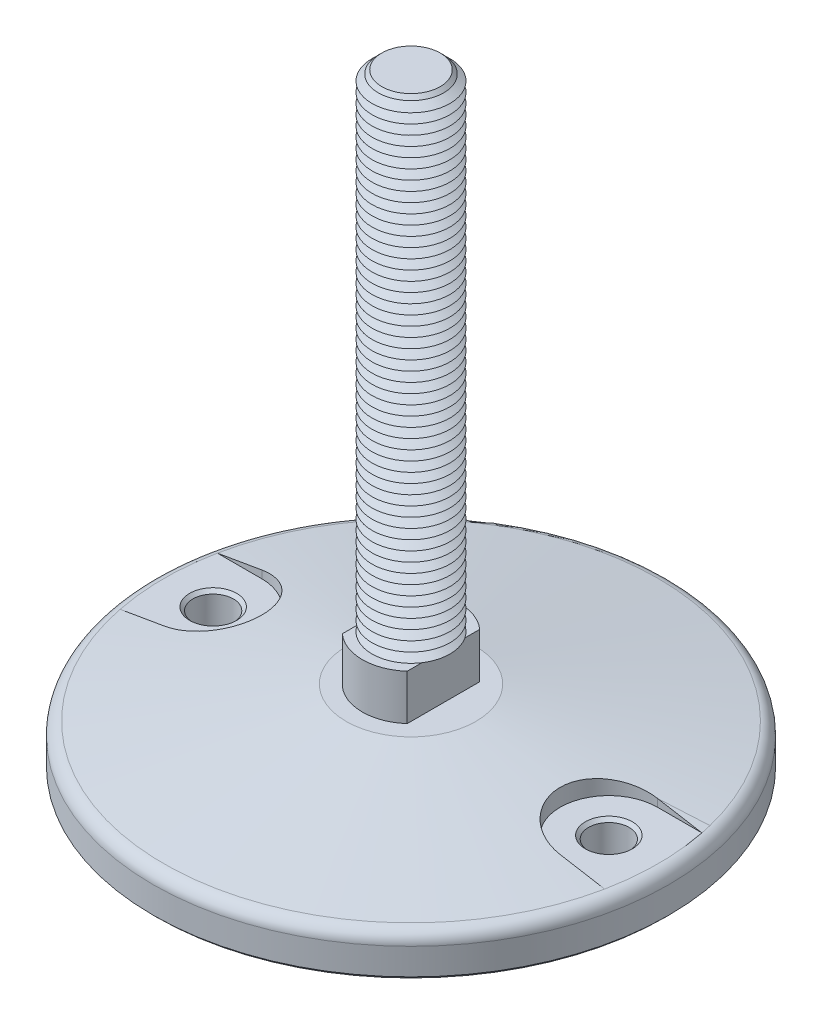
from build123d import *

# Parameters (mm, degrees)
FILLET1_R                = 4
SKETCH3_R                = 15
BOSS_EXTRUDE1_DEPTH      = 14
CUT_EXTRUDE1_START       = -14
CUT_EXTRUDE1_DEPTH       = 14
SKETCH5_R                = 12
BOSS_EXTRUDE2_DEPTH      = 150
CHAMFER1_SIZE            = 3
LPATTERN1_COUNT          = 50
LPATTERN1_PITCH          = 3
CUT_EXTRUDE4_DEPTH       = 9.91
SKETCH10_R               = 6.25
CUT_EXTRUDE5_DEPTH       = 13.09
CHAMFER2_SIZE            = 1
CHAMFER2_OF_MIRROR1_SIZE = 1
CHAMFER3_SIZE            = 1


with BuildPart() as part:
    # Sketch2 → Revolve1 (revolve)
    with BuildSketch(Plane(origin=(0, 0, 0), x_dir=(0, 0, -1), z_dir=(1, 0, 0)), mode=Mode.PRIVATE) as revolve1_sk:
        Polygon((0, 0), (-20, 0), (-79.5, -10.491455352), (-79.5, -23), (0, -23), align=None)
    revolve(revolve1_sk.sketch.rotate(Axis((0, 61.338865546, 0), (0, -1, 0)), 180), axis=Axis((0, 61.338865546, 0), (0, -1, 0)))

    # Fillet1
    fillet1_edges = [part.edges().sort_by_distance(p)[0] for p in [
        (0, -10.491455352, 79.5),
    ]]
    fillet(fillet1_edges, radius=FILLET1_R)

    # Sketch3 → Boss-Extrude1 (add)
    with BuildSketch(Plane(origin=(0, 0, 0), x_dir=(1, 0, 0), z_dir=(0, 1, 0))):
        with Locations(Location((0, 0, 0), (0, 0, 270))):
            Circle(SKETCH3_R)
    extrude(amount=BOSS_EXTRUDE1_DEPTH)

    # Sketch4 → Cut-Extrude1 (cut)
    with BuildSketch(Plane(origin=(0, 14, 0), x_dir=(1, 0, 0), z_dir=(0, 1, 0)).offset(CUT_EXTRUDE1_START)):
        with BuildLine():
            Line((-10, 11.180339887), (-10, -11.180339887))
            ThreePointArc((-10, -11.180339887), (-15, 0), (-10, 11.180339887))
        make_face()
        with BuildLine():
            Line((10, -11.180339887), (10, 11.180339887))
            ThreePointArc((10, 11.180339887), (15, 0), (10, -11.180339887))
        make_face()
    extrude(amount=CUT_EXTRUDE1_DEPTH, mode=Mode.SUBTRACT)

    # Sketch5 → Boss-Extrude2 (add)
    with BuildSketch(Plane(origin=(0, 14, 0), x_dir=(1, 0, 0), z_dir=(0, 1, 0))):
        with Locations(Location((0, 0, 0), (0, 0, 33.557309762))):
            Circle(SKETCH5_R)
    extrude(amount=BOSS_EXTRUDE2_DEPTH)

    # Chamfer1
    chamfer1_edges = [part.edges().sort_by_distance(p)[0] for p in [
        (-10, 164, 6.633249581),
    ]]
    chamfer(chamfer1_edges, length=CHAMFER1_SIZE)

    # Sketch6 → Cut-Revolve1 (revolve, cut)
    with BuildSketch(Plane(origin=(0, 0, 0), x_dir=(0, 0, -1), z_dir=(1, 0, 0)), mode=Mode.PRIVATE) as cut_revolve1_sk:
        Polygon((-12, 14), (-9.401923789, 15.5), (-12, 17), align=None)
    cut_revolve1 = revolve(cut_revolve1_sk.sketch.rotate(Axis((0, 61.338865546, 0), (0, -1, 0)), 180), axis=Axis((0, 61.338865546, 0), (0, -1, 0)), mode=Mode.SUBTRACT)

    # LPattern1: Cut-Revolve1 ×50
    with Locations(*[(0, i * LPATTERN1_PITCH, 0) for i in range(1, LPATTERN1_COUNT)]):
        add(cut_revolve1, mode=Mode.SUBTRACT)

    # Sketch8 → Cut-Extrude4 (cut)
    with BuildSketch(Plane(origin=(0, 0, 0), x_dir=(1, 0, 0), z_dir=(0, 1, 0))):
        with BuildLine():
            Line((-61, 15), (-74.703520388, 15))
            ThreePointArc((-74.703520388, 15), (-76.194592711, 0), (-74.703520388, -15))
            Line((-74.703520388, -15), (-61, -15))
            ThreePointArc((-61, -15), (-46, 0), (-61, 15))
        make_face()
    cut_extrude4 = extrude(amount=-CUT_EXTRUDE4_DEPTH, mode=Mode.SUBTRACT)

    # Sketch10 → Cut-Extrude5 (cut)
    with BuildSketch(Plane(origin=(0, -9.91, 0), x_dir=(1, 0, 0), z_dir=(0, 1, 0))):
        with Locations(Location((-61, 0, 0), (0, 0, 270))):
            Circle(SKETCH10_R)
    cut_extrude5 = extrude(amount=-CUT_EXTRUDE5_DEPTH, mode=Mode.SUBTRACT)

    # Chamfer2
    chamfer2_edges = [part.edges().sort_by_distance(p)[0] for p in [
        (-61, -9.91, -6.25),
        (-61, -23, -6.25),
    ]]
    chamfer(chamfer2_edges, length=CHAMFER2_SIZE)

    # Mirror1: Cut-Extrude4, Cut-Extrude5 across plane
    add(cut_extrude4.mirror(Plane(origin=(0, 0, 0), x_dir=(0, 0, 1), z_dir=(1, 0, 0))), mode=Mode.SUBTRACT)
    add(cut_extrude5.mirror(Plane(origin=(0, 0, 0), x_dir=(0, 0, 1), z_dir=(1, 0, 0))), mode=Mode.SUBTRACT)

    # Chamfer2 of Mirror1
    chamfer2_of_mirror1_edges = [part.edges().sort_by_distance(p)[0] for p in [
        (61, -9.91, -6.25),
        (61, -23, -6.25),
    ]]
    chamfer(chamfer2_of_mirror1_edges, length=CHAMFER2_OF_MIRROR1_SIZE)

    # Chamfer3
    chamfer3_edges = [part.edges().sort_by_distance(p)[0] for p in [
        (0, -23, 79.5),
    ]]
    chamfer(chamfer3_edges, length=CHAMFER3_SIZE)


solid = part.part
